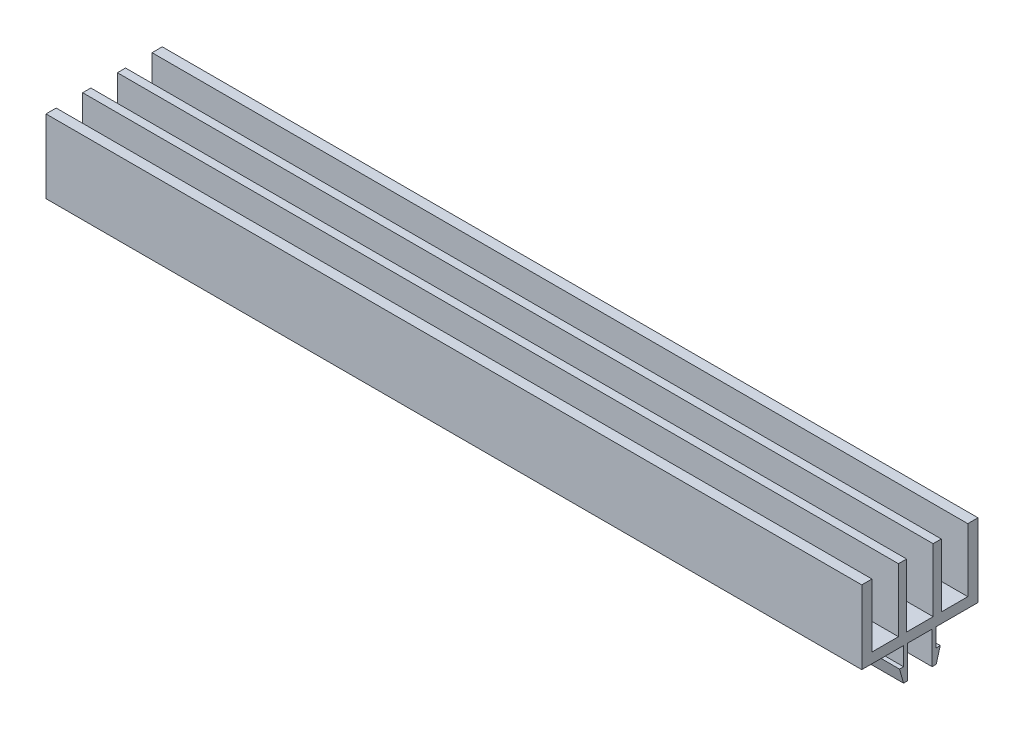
ISO-10303-21;
HEADER;
FILE_DESCRIPTION(('STEP AP214'),'2;1');
FILE_NAME('part.step','',(''),(''),'','','');
FILE_SCHEMA(('AUTOMOTIVE_DESIGN { 1 0 10303 214 1 1 1 1 }'));
ENDSEC;
DATA;
#1=APPLICATION_CONTEXT('core data for automotive mechanical design processes');
#2=APPLICATION_PROTOCOL_DEFINITION('international standard','automotive_design',2000,#1);
#3=PRODUCT_CONTEXT('',#1,'mechanical');
#4=PRODUCT('Part','Part','',(#3));
#5=PRODUCT_RELATED_PRODUCT_CATEGORY('part','',(#4));
#6=PRODUCT_DEFINITION_FORMATION('','',#4);
#7=PRODUCT_DEFINITION_CONTEXT('part definition',#1,'design');
#8=PRODUCT_DEFINITION('design','',#6,#7);
#9=PRODUCT_DEFINITION_SHAPE('','',#8);
#10=(LENGTH_UNIT() NAMED_UNIT(*) SI_UNIT(.MILLI.,.METRE.));
#11=(NAMED_UNIT(*) PLANE_ANGLE_UNIT() SI_UNIT($,.RADIAN.));
#12=(NAMED_UNIT(*) SI_UNIT($,.STERADIAN.) SOLID_ANGLE_UNIT());
#13=UNCERTAINTY_MEASURE_WITH_UNIT(LENGTH_MEASURE(1.E-05),#10,'distance_accuracy_value','');
#14=(GEOMETRIC_REPRESENTATION_CONTEXT(3) GLOBAL_UNCERTAINTY_ASSIGNED_CONTEXT((#13)) GLOBAL_UNIT_ASSIGNED_CONTEXT((#10,
#11,#12)) REPRESENTATION_CONTEXT('',''));
#15=CARTESIAN_POINT('',(0.,0.,0.));
#16=DIRECTION('',(0.,0.,1.));
#17=DIRECTION('',(1.,0.,0.));
#18=AXIS2_PLACEMENT_3D('',#15,#16,#17);
#19=CARTESIAN_POINT('',(200.,-9.434447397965,-4.13110520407));
#20=DIRECTION('',(0.,0.,1.));
#21=DIRECTION('',(1.,0.,0.));
#22=AXIS2_PLACEMENT_3D('',#19,#20,#21);
#23=PLANE('',#22);
#24=DIRECTION('',(0.,1.,0.));
#25=VECTOR('',#24,1.);
#26=CARTESIAN_POINT('',(0.,-9.434447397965,-4.13110520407));
#27=LINE('',#26,#25);
#28=CARTESIAN_POINT('',(0.,-9.434447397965,-4.13110520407));
#29=VERTEX_POINT('',#28);
#30=CARTESIAN_POINT('',(0.,-4.934447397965,-4.13110520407));
#31=VERTEX_POINT('',#30);
#32=EDGE_CURVE('E357',#29,#31,#27,.T.);
#33=ORIENTED_EDGE('',*,*,#32,.T.);
#34=DIRECTION('',(-1.,0.,0.));
#35=VECTOR('',#34,1.);
#36=CARTESIAN_POINT('',(200.,-4.934447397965,-4.13110520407));
#37=LINE('',#36,#35);
#38=CARTESIAN_POINT('',(200.,-4.934447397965,-4.13110520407));
#39=VERTEX_POINT('',#38);
#40=EDGE_CURVE('E13',#39,#31,#37,.T.);
#41=ORIENTED_EDGE('',*,*,#40,.F.);
#42=DIRECTION('',(0.,1.,0.));
#43=VECTOR('',#42,1.);
#44=CARTESIAN_POINT('',(200.,-9.434447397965,-4.13110520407));
#45=LINE('',#44,#43);
#46=CARTESIAN_POINT('',(200.,-9.434447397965,-4.13110520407));
#47=VERTEX_POINT('',#46);
#48=EDGE_CURVE('E439',#47,#39,#45,.T.);
#49=ORIENTED_EDGE('',*,*,#48,.F.);
#50=DIRECTION('',(-1.,0.,0.));
#51=VECTOR('',#50,1.);
#52=CARTESIAN_POINT('',(200.,-9.434447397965,-4.13110520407));
#53=LINE('',#52,#51);
#54=EDGE_CURVE('E353',#47,#29,#53,.T.);
#55=ORIENTED_EDGE('',*,*,#54,.T.);
#56=EDGE_LOOP('',(#33,#41,#49,#55));
#57=FACE_BOUND('',#56,.T.);
#58=ADVANCED_FACE('F136',(#57),#23,.F.);
#59=CARTESIAN_POINT('',(200.,-4.934447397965,-4.13110520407));
#60=DIRECTION('',(0.,1.,0.));
#61=DIRECTION('',(0.,0.,1.));
#62=AXIS2_PLACEMENT_3D('',#59,#60,#61);
#63=PLANE('',#62);
#64=DIRECTION('',(0.,0.,-1.));
#65=VECTOR('',#64,1.);
#66=CARTESIAN_POINT('',(0.,-4.934447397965,-4.13110520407));
#67=LINE('',#66,#65);
#68=CARTESIAN_POINT('',(0.,-4.93444739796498,-14.38110520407));
#69=VERTEX_POINT('',#68);
#70=EDGE_CURVE('E361',#31,#69,#67,.T.);
#71=ORIENTED_EDGE('',*,*,#70,.T.);
#72=DIRECTION('',(-1.,0.,0.));
#73=VECTOR('',#72,1.);
#74=CARTESIAN_POINT('',(200.,-4.93444739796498,-14.38110520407));
#75=LINE('',#74,#73);
#76=CARTESIAN_POINT('',(200.,-4.93444739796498,-14.38110520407));
#77=VERTEX_POINT('',#76);
#78=EDGE_CURVE('E145',#77,#69,#75,.T.);
#79=ORIENTED_EDGE('',*,*,#78,.F.);
#80=DIRECTION('',(0.,0.,-1.));
#81=VECTOR('',#80,1.);
#82=CARTESIAN_POINT('',(200.,-4.934447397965,-4.13110520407));
#83=LINE('',#82,#81);
#84=EDGE_CURVE('E256',#39,#77,#83,.T.);
#85=ORIENTED_EDGE('',*,*,#84,.F.);
#86=ORIENTED_EDGE('',*,*,#40,.T.);
#87=EDGE_LOOP('',(#71,#79,#85,#86));
#88=FACE_BOUND('',#87,.T.);
#89=ADVANCED_FACE('F645',(#88),#63,.F.);
#90=CARTESIAN_POINT('',(200.,-4.93444739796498,-14.38110520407));
#91=DIRECTION('',(0.,0.,1.));
#92=DIRECTION('',(1.,0.,0.));
#93=AXIS2_PLACEMENT_3D('',#90,#91,#92);
#94=PLANE('',#93);
#95=DIRECTION('',(0.,1.,0.));
#96=VECTOR('',#95,1.);
#97=CARTESIAN_POINT('',(0.,-4.93444739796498,-14.38110520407));
#98=LINE('',#97,#96);
#99=CARTESIAN_POINT('',(0.,13.065552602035,-14.38110520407));
#100=VERTEX_POINT('',#99);
#101=EDGE_CURVE('E364',#69,#100,#98,.T.);
#102=ORIENTED_EDGE('',*,*,#101,.T.);
#103=DIRECTION('',(-1.,0.,0.));
#104=VECTOR('',#103,1.);
#105=CARTESIAN_POINT('',(200.,13.065552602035,-14.38110520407));
#106=LINE('',#105,#104);
#107=CARTESIAN_POINT('',(200.,13.065552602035,-14.38110520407));
#108=VERTEX_POINT('',#107);
#109=EDGE_CURVE('E530',#108,#100,#106,.T.);
#110=ORIENTED_EDGE('',*,*,#109,.F.);
#111=DIRECTION('',(0.,1.,0.));
#112=VECTOR('',#111,1.);
#113=CARTESIAN_POINT('',(200.,-4.93444739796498,-14.38110520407));
#114=LINE('',#113,#112);
#115=EDGE_CURVE('E540',#77,#108,#114,.T.);
#116=ORIENTED_EDGE('',*,*,#115,.F.);
#117=ORIENTED_EDGE('',*,*,#78,.T.);
#118=EDGE_LOOP('',(#102,#110,#116,#117));
#119=FACE_BOUND('',#118,.T.);
#120=ADVANCED_FACE('F538',(#119),#94,.F.);
#121=CARTESIAN_POINT('',(200.,13.065552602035,-14.38110520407));
#122=DIRECTION('',(0.,-1.,0.));
#123=DIRECTION('',(0.,0.,-1.));
#124=AXIS2_PLACEMENT_3D('',#121,#122,#123);
#125=PLANE('',#124);
#126=DIRECTION('',(0.,0.,1.));
#127=VECTOR('',#126,1.);
#128=CARTESIAN_POINT('',(0.,13.065552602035,-14.38110520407));
#129=LINE('',#128,#127);
#130=CARTESIAN_POINT('',(0.,13.065552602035,-11.88110520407));
#131=VERTEX_POINT('',#130);
#132=EDGE_CURVE('E367',#100,#131,#129,.T.);
#133=ORIENTED_EDGE('',*,*,#132,.T.);
#134=DIRECTION('',(-1.,0.,0.));
#135=VECTOR('',#134,1.);
#136=CARTESIAN_POINT('',(200.,13.065552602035,-11.88110520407));
#137=LINE('',#136,#135);
#138=CARTESIAN_POINT('',(200.,13.065552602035,-11.88110520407));
#139=VERTEX_POINT('',#138);
#140=EDGE_CURVE('E526',#139,#131,#137,.T.);
#141=ORIENTED_EDGE('',*,*,#140,.F.);
#142=DIRECTION('',(0.,0.,1.));
#143=VECTOR('',#142,1.);
#144=CARTESIAN_POINT('',(200.,13.065552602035,-14.38110520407));
#145=LINE('',#144,#143);
#146=EDGE_CURVE('E559',#108,#139,#145,.T.);
#147=ORIENTED_EDGE('',*,*,#146,.F.);
#148=ORIENTED_EDGE('',*,*,#109,.T.);
#149=EDGE_LOOP('',(#133,#141,#147,#148));
#150=FACE_BOUND('',#149,.T.);
#151=ADVANCED_FACE('F549',(#150),#125,.F.);
#152=CARTESIAN_POINT('',(200.,13.065552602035,-11.88110520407));
#153=DIRECTION('',(0.,0.,-1.));
#154=DIRECTION('',(-1.,0.,0.));
#155=AXIS2_PLACEMENT_3D('',#152,#153,#154);
#156=PLANE('',#155);
#157=DIRECTION('',(0.,-1.,0.));
#158=VECTOR('',#157,1.);
#159=CARTESIAN_POINT('',(0.,13.065552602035,-11.88110520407));
#160=LINE('',#159,#158);
#161=CARTESIAN_POINT('',(0.,-2.434447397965,-11.88110520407));
#162=VERTEX_POINT('',#161);
#163=EDGE_CURVE('E370',#131,#162,#160,.T.);
#164=ORIENTED_EDGE('',*,*,#163,.T.);
#165=DIRECTION('',(-1.,0.,0.));
#166=VECTOR('',#165,1.);
#167=CARTESIAN_POINT('',(200.,-2.434447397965,-11.88110520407));
#168=LINE('',#167,#166);
#169=CARTESIAN_POINT('',(200.,-2.434447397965,-11.88110520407));
#170=VERTEX_POINT('',#169);
#171=EDGE_CURVE('E522',#170,#162,#168,.T.);
#172=ORIENTED_EDGE('',*,*,#171,.F.);
#173=DIRECTION('',(0.,-1.,0.));
#174=VECTOR('',#173,1.);
#175=CARTESIAN_POINT('',(200.,13.065552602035,-11.88110520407));
#176=LINE('',#175,#174);
#177=EDGE_CURVE('E555',#139,#170,#176,.T.);
#178=ORIENTED_EDGE('',*,*,#177,.F.);
#179=ORIENTED_EDGE('',*,*,#140,.T.);
#180=EDGE_LOOP('',(#164,#172,#178,#179));
#181=FACE_BOUND('',#180,.T.);
#182=ADVANCED_FACE('F553',(#181),#156,.F.);
#183=CARTESIAN_POINT('',(200.,-2.434447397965,-11.88110520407));
#184=DIRECTION('',(0.,-1.,0.));
#185=DIRECTION('',(0.,0.,-1.));
#186=AXIS2_PLACEMENT_3D('',#183,#184,#185);
#187=PLANE('',#186);
#188=DIRECTION('',(0.,0.,1.));
#189=VECTOR('',#188,1.);
#190=CARTESIAN_POINT('',(0.,-2.434447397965,-11.88110520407));
#191=LINE('',#190,#189);
#192=CARTESIAN_POINT('',(0.,-2.434447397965,-5.38110520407));
#193=VERTEX_POINT('',#192);
#194=EDGE_CURVE('E373',#162,#193,#191,.T.);
#195=ORIENTED_EDGE('',*,*,#194,.T.);
#196=DIRECTION('',(-1.,0.,0.));
#197=VECTOR('',#196,1.);
#198=CARTESIAN_POINT('',(200.,-2.434447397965,-5.38110520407));
#199=LINE('',#198,#197);
#200=CARTESIAN_POINT('',(200.,-2.434447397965,-5.38110520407));
#201=VERTEX_POINT('',#200);
#202=EDGE_CURVE('E518',#201,#193,#199,.T.);
#203=ORIENTED_EDGE('',*,*,#202,.F.);
#204=DIRECTION('',(0.,0.,1.));
#205=VECTOR('',#204,1.);
#206=CARTESIAN_POINT('',(200.,-2.434447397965,-11.88110520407));
#207=LINE('',#206,#205);
#208=EDGE_CURVE('E558',#170,#201,#207,.T.);
#209=ORIENTED_EDGE('',*,*,#208,.F.);
#210=ORIENTED_EDGE('',*,*,#171,.T.);
#211=EDGE_LOOP('',(#195,#203,#209,#210));
#212=FACE_BOUND('',#211,.T.);
#213=ADVANCED_FACE('F658',(#212),#187,.F.);
#214=CARTESIAN_POINT('',(200.,-2.434447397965,-5.38110520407));
#215=DIRECTION('',(0.,0.,1.));
#216=DIRECTION('',(1.,0.,0.));
#217=AXIS2_PLACEMENT_3D('',#214,#215,#216);
#218=PLANE('',#217);
#219=DIRECTION('',(0.,1.,0.));
#220=VECTOR('',#219,1.);
#221=CARTESIAN_POINT('',(0.,-2.434447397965,-5.38110520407));
#222=LINE('',#221,#220);
#223=CARTESIAN_POINT('',(0.,13.065552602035,-5.38110520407));
#224=VERTEX_POINT('',#223);
#225=EDGE_CURVE('E376',#193,#224,#222,.T.);
#226=ORIENTED_EDGE('',*,*,#225,.T.);
#227=DIRECTION('',(-1.,0.,0.));
#228=VECTOR('',#227,1.);
#229=CARTESIAN_POINT('',(200.,13.065552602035,-5.38110520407));
#230=LINE('',#229,#228);
#231=CARTESIAN_POINT('',(200.,13.065552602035,-5.38110520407));
#232=VERTEX_POINT('',#231);
#233=EDGE_CURVE('E514',#232,#224,#230,.T.);
#234=ORIENTED_EDGE('',*,*,#233,.F.);
#235=DIRECTION('',(0.,1.,0.));
#236=VECTOR('',#235,1.);
#237=CARTESIAN_POINT('',(200.,-2.434447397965,-5.38110520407));
#238=LINE('',#237,#236);
#239=EDGE_CURVE('E563',#201,#232,#238,.T.);
#240=ORIENTED_EDGE('',*,*,#239,.F.);
#241=ORIENTED_EDGE('',*,*,#202,.T.);
#242=EDGE_LOOP('',(#226,#234,#240,#241));
#243=FACE_BOUND('',#242,.T.);
#244=ADVANCED_FACE('F661',(#243),#218,.F.);
#245=CARTESIAN_POINT('',(200.,13.065552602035,-5.38110520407));
#246=DIRECTION('',(0.,-1.,0.));
#247=DIRECTION('',(0.,0.,-1.));
#248=AXIS2_PLACEMENT_3D('',#245,#246,#247);
#249=PLANE('',#248);
#250=DIRECTION('',(0.,0.,1.));
#251=VECTOR('',#250,1.);
#252=CARTESIAN_POINT('',(0.,13.065552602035,-5.38110520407));
#253=LINE('',#252,#251);
#254=CARTESIAN_POINT('',(0.,13.065552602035,-3.38110520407));
#255=VERTEX_POINT('',#254);
#256=EDGE_CURVE('E379',#224,#255,#253,.T.);
#257=ORIENTED_EDGE('',*,*,#256,.T.);
#258=DIRECTION('',(-1.,0.,0.));
#259=VECTOR('',#258,1.);
#260=CARTESIAN_POINT('',(200.,13.065552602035,-3.38110520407));
#261=LINE('',#260,#259);
#262=CARTESIAN_POINT('',(200.,13.065552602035,-3.38110520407));
#263=VERTEX_POINT('',#262);
#264=EDGE_CURVE('E510',#263,#255,#261,.T.);
#265=ORIENTED_EDGE('',*,*,#264,.F.);
#266=DIRECTION('',(0.,0.,1.));
#267=VECTOR('',#266,1.);
#268=CARTESIAN_POINT('',(200.,13.065552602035,-5.38110520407));
#269=LINE('',#268,#267);
#270=EDGE_CURVE('E570',#232,#263,#269,.T.);
#271=ORIENTED_EDGE('',*,*,#270,.F.);
#272=ORIENTED_EDGE('',*,*,#233,.T.);
#273=EDGE_LOOP('',(#257,#265,#271,#272));
#274=FACE_BOUND('',#273,.T.);
#275=ADVANCED_FACE('F665',(#274),#249,.F.);
#276=CARTESIAN_POINT('',(200.,13.065552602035,-3.38110520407));
#277=DIRECTION('',(0.,0.,-1.));
#278=DIRECTION('',(-1.,0.,0.));
#279=AXIS2_PLACEMENT_3D('',#276,#277,#278);
#280=PLANE('',#279);
#281=DIRECTION('',(0.,-1.,0.));
#282=VECTOR('',#281,1.);
#283=CARTESIAN_POINT('',(0.,13.065552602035,-3.38110520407));
#284=LINE('',#283,#282);
#285=CARTESIAN_POINT('',(0.,-2.434447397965,-3.38110520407));
#286=VERTEX_POINT('',#285);
#287=EDGE_CURVE('E382',#255,#286,#284,.T.);
#288=ORIENTED_EDGE('',*,*,#287,.T.);
#289=DIRECTION('',(-1.,0.,0.));
#290=VECTOR('',#289,1.);
#291=CARTESIAN_POINT('',(200.,-2.434447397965,-3.38110520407));
#292=LINE('',#291,#290);
#293=CARTESIAN_POINT('',(200.,-2.434447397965,-3.38110520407));
#294=VERTEX_POINT('',#293);
#295=EDGE_CURVE('E506',#294,#286,#292,.T.);
#296=ORIENTED_EDGE('',*,*,#295,.F.);
#297=DIRECTION('',(0.,-1.,0.));
#298=VECTOR('',#297,1.);
#299=CARTESIAN_POINT('',(200.,13.065552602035,-3.38110520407));
#300=LINE('',#299,#298);
#301=EDGE_CURVE('E573',#263,#294,#300,.T.);
#302=ORIENTED_EDGE('',*,*,#301,.F.);
#303=ORIENTED_EDGE('',*,*,#264,.T.);
#304=EDGE_LOOP('',(#288,#296,#302,#303));
#305=FACE_BOUND('',#304,.T.);
#306=ADVANCED_FACE('F669',(#305),#280,.F.);
#307=CARTESIAN_POINT('',(200.,-2.434447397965,-3.38110520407));
#308=DIRECTION('',(0.,-1.,0.));
#309=DIRECTION('',(0.,0.,-1.));
#310=AXIS2_PLACEMENT_3D('',#307,#308,#309);
#311=PLANE('',#310);
#312=DIRECTION('',(0.,0.,1.));
#313=VECTOR('',#312,1.);
#314=CARTESIAN_POINT('',(0.,-2.434447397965,-3.38110520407));
#315=LINE('',#314,#313);
#316=CARTESIAN_POINT('',(0.,-2.434447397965,3.11889479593));
#317=VERTEX_POINT('',#316);
#318=EDGE_CURVE('E385',#286,#317,#315,.T.);
#319=ORIENTED_EDGE('',*,*,#318,.T.);
#320=DIRECTION('',(-1.,0.,0.));
#321=VECTOR('',#320,1.);
#322=CARTESIAN_POINT('',(200.,-2.434447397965,3.11889479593));
#323=LINE('',#322,#321);
#324=CARTESIAN_POINT('',(200.,-2.434447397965,3.11889479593));
#325=VERTEX_POINT('',#324);
#326=EDGE_CURVE('E502',#325,#317,#323,.T.);
#327=ORIENTED_EDGE('',*,*,#326,.F.);
#328=DIRECTION('',(0.,0.,1.));
#329=VECTOR('',#328,1.);
#330=CARTESIAN_POINT('',(200.,-2.434447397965,-3.38110520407));
#331=LINE('',#330,#329);
#332=EDGE_CURVE('E576',#294,#325,#331,.T.);
#333=ORIENTED_EDGE('',*,*,#332,.F.);
#334=ORIENTED_EDGE('',*,*,#295,.T.);
#335=EDGE_LOOP('',(#319,#327,#333,#334));
#336=FACE_BOUND('',#335,.T.);
#337=ADVANCED_FACE('F673',(#336),#311,.F.);
#338=CARTESIAN_POINT('',(200.,-2.434447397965,3.11889479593));
#339=DIRECTION('',(0.,0.,1.));
#340=DIRECTION('',(1.,0.,0.));
#341=AXIS2_PLACEMENT_3D('',#338,#339,#340);
#342=PLANE('',#341);
#343=DIRECTION('',(0.,1.,0.));
#344=VECTOR('',#343,1.);
#345=CARTESIAN_POINT('',(0.,-2.434447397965,3.11889479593));
#346=LINE('',#345,#344);
#347=CARTESIAN_POINT('',(0.,13.065552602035,3.11889479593));
#348=VERTEX_POINT('',#347);
#349=EDGE_CURVE('E388',#317,#348,#346,.T.);
#350=ORIENTED_EDGE('',*,*,#349,.T.);
#351=DIRECTION('',(-1.,0.,0.));
#352=VECTOR('',#351,1.);
#353=CARTESIAN_POINT('',(200.,13.065552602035,3.11889479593));
#354=LINE('',#353,#352);
#355=CARTESIAN_POINT('',(200.,13.065552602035,3.11889479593));
#356=VERTEX_POINT('',#355);
#357=EDGE_CURVE('E498',#356,#348,#354,.T.);
#358=ORIENTED_EDGE('',*,*,#357,.F.);
#359=DIRECTION('',(0.,1.,0.));
#360=VECTOR('',#359,1.);
#361=CARTESIAN_POINT('',(200.,-2.434447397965,3.11889479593));
#362=LINE('',#361,#360);
#363=EDGE_CURVE('E579',#325,#356,#362,.T.);
#364=ORIENTED_EDGE('',*,*,#363,.F.);
#365=ORIENTED_EDGE('',*,*,#326,.T.);
#366=EDGE_LOOP('',(#350,#358,#364,#365));
#367=FACE_BOUND('',#366,.T.);
#368=ADVANCED_FACE('F677',(#367),#342,.F.);
#369=CARTESIAN_POINT('',(200.,13.065552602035,3.11889479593));
#370=DIRECTION('',(0.,-1.,0.));
#371=DIRECTION('',(0.,0.,-1.));
#372=AXIS2_PLACEMENT_3D('',#369,#370,#371);
#373=PLANE('',#372);
#374=DIRECTION('',(0.,0.,1.));
#375=VECTOR('',#374,1.);
#376=CARTESIAN_POINT('',(0.,13.065552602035,3.11889479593));
#377=LINE('',#376,#375);
#378=CARTESIAN_POINT('',(0.,13.065552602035,5.11889479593));
#379=VERTEX_POINT('',#378);
#380=EDGE_CURVE('E391',#348,#379,#377,.T.);
#381=ORIENTED_EDGE('',*,*,#380,.T.);
#382=DIRECTION('',(-1.,0.,0.));
#383=VECTOR('',#382,1.);
#384=CARTESIAN_POINT('',(200.,13.065552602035,5.11889479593));
#385=LINE('',#384,#383);
#386=CARTESIAN_POINT('',(200.,13.065552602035,5.11889479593));
#387=VERTEX_POINT('',#386);
#388=EDGE_CURVE('E494',#387,#379,#385,.T.);
#389=ORIENTED_EDGE('',*,*,#388,.F.);
#390=DIRECTION('',(0.,0.,1.));
#391=VECTOR('',#390,1.);
#392=CARTESIAN_POINT('',(200.,13.065552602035,3.11889479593));
#393=LINE('',#392,#391);
#394=EDGE_CURVE('E582',#356,#387,#393,.T.);
#395=ORIENTED_EDGE('',*,*,#394,.F.);
#396=ORIENTED_EDGE('',*,*,#357,.T.);
#397=EDGE_LOOP('',(#381,#389,#395,#396));
#398=FACE_BOUND('',#397,.T.);
#399=ADVANCED_FACE('F681',(#398),#373,.F.);
#400=CARTESIAN_POINT('',(200.,13.065552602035,5.11889479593));
#401=DIRECTION('',(0.,0.,-1.));
#402=DIRECTION('',(-1.,0.,0.));
#403=AXIS2_PLACEMENT_3D('',#400,#401,#402);
#404=PLANE('',#403);
#405=DIRECTION('',(0.,-1.,0.));
#406=VECTOR('',#405,1.);
#407=CARTESIAN_POINT('',(0.,13.065552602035,5.11889479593));
#408=LINE('',#407,#406);
#409=CARTESIAN_POINT('',(0.,-2.434447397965,5.11889479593));
#410=VERTEX_POINT('',#409);
#411=EDGE_CURVE('E394',#379,#410,#408,.T.);
#412=ORIENTED_EDGE('',*,*,#411,.T.);
#413=DIRECTION('',(-1.,0.,0.));
#414=VECTOR('',#413,1.);
#415=CARTESIAN_POINT('',(200.,-2.434447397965,5.11889479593));
#416=LINE('',#415,#414);
#417=CARTESIAN_POINT('',(200.,-2.434447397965,5.11889479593));
#418=VERTEX_POINT('',#417);
#419=EDGE_CURVE('E490',#418,#410,#416,.T.);
#420=ORIENTED_EDGE('',*,*,#419,.F.);
#421=DIRECTION('',(0.,-1.,0.));
#422=VECTOR('',#421,1.);
#423=CARTESIAN_POINT('',(200.,13.065552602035,5.11889479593));
#424=LINE('',#423,#422);
#425=EDGE_CURVE('E585',#387,#418,#424,.T.);
#426=ORIENTED_EDGE('',*,*,#425,.F.);
#427=ORIENTED_EDGE('',*,*,#388,.T.);
#428=EDGE_LOOP('',(#412,#420,#426,#427));
#429=FACE_BOUND('',#428,.T.);
#430=ADVANCED_FACE('F685',(#429),#404,.F.);
#431=CARTESIAN_POINT('',(200.,-2.434447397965,5.11889479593));
#432=DIRECTION('',(0.,-1.,0.));
#433=DIRECTION('',(0.,0.,-1.));
#434=AXIS2_PLACEMENT_3D('',#431,#432,#433);
#435=PLANE('',#434);
#436=DIRECTION('',(0.,0.,1.));
#437=VECTOR('',#436,1.);
#438=CARTESIAN_POINT('',(0.,-2.434447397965,5.11889479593));
#439=LINE('',#438,#437);
#440=CARTESIAN_POINT('',(0.,-2.434447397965,11.61889479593));
#441=VERTEX_POINT('',#440);
#442=EDGE_CURVE('E397',#410,#441,#439,.T.);
#443=ORIENTED_EDGE('',*,*,#442,.T.);
#444=DIRECTION('',(-1.,0.,0.));
#445=VECTOR('',#444,1.);
#446=CARTESIAN_POINT('',(200.,-2.434447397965,11.61889479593));
#447=LINE('',#446,#445);
#448=CARTESIAN_POINT('',(200.,-2.434447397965,11.61889479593));
#449=VERTEX_POINT('',#448);
#450=EDGE_CURVE('E486',#449,#441,#447,.T.);
#451=ORIENTED_EDGE('',*,*,#450,.F.);
#452=DIRECTION('',(0.,0.,1.));
#453=VECTOR('',#452,1.);
#454=CARTESIAN_POINT('',(200.,-2.434447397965,5.11889479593));
#455=LINE('',#454,#453);
#456=EDGE_CURVE('E588',#418,#449,#455,.T.);
#457=ORIENTED_EDGE('',*,*,#456,.F.);
#458=ORIENTED_EDGE('',*,*,#419,.T.);
#459=EDGE_LOOP('',(#443,#451,#457,#458));
#460=FACE_BOUND('',#459,.T.);
#461=ADVANCED_FACE('F689',(#460),#435,.F.);
#462=CARTESIAN_POINT('',(200.,-2.434447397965,11.61889479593));
#463=DIRECTION('',(0.,0.,1.));
#464=DIRECTION('',(1.,0.,0.));
#465=AXIS2_PLACEMENT_3D('',#462,#463,#464);
#466=PLANE('',#465);
#467=DIRECTION('',(0.,1.,0.));
#468=VECTOR('',#467,1.);
#469=CARTESIAN_POINT('',(0.,-2.434447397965,11.61889479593));
#470=LINE('',#469,#468);
#471=CARTESIAN_POINT('',(0.,13.065552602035,11.61889479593));
#472=VERTEX_POINT('',#471);
#473=EDGE_CURVE('E400',#441,#472,#470,.T.);
#474=ORIENTED_EDGE('',*,*,#473,.T.);
#475=DIRECTION('',(-1.,0.,0.));
#476=VECTOR('',#475,1.);
#477=CARTESIAN_POINT('',(200.,13.065552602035,11.61889479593));
#478=LINE('',#477,#476);
#479=CARTESIAN_POINT('',(200.,13.065552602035,11.61889479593));
#480=VERTEX_POINT('',#479);
#481=EDGE_CURVE('E482',#480,#472,#478,.T.);
#482=ORIENTED_EDGE('',*,*,#481,.F.);
#483=DIRECTION('',(0.,1.,0.));
#484=VECTOR('',#483,1.);
#485=CARTESIAN_POINT('',(200.,-2.434447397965,11.61889479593));
#486=LINE('',#485,#484);
#487=EDGE_CURVE('E591',#449,#480,#486,.T.);
#488=ORIENTED_EDGE('',*,*,#487,.F.);
#489=ORIENTED_EDGE('',*,*,#450,.T.);
#490=EDGE_LOOP('',(#474,#482,#488,#489));
#491=FACE_BOUND('',#490,.T.);
#492=ADVANCED_FACE('F693',(#491),#466,.F.);
#493=CARTESIAN_POINT('',(200.,13.065552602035,11.61889479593));
#494=DIRECTION('',(0.,-1.,0.));
#495=DIRECTION('',(0.,0.,-1.));
#496=AXIS2_PLACEMENT_3D('',#493,#494,#495);
#497=PLANE('',#496);
#498=DIRECTION('',(0.,0.,1.));
#499=VECTOR('',#498,1.);
#500=CARTESIAN_POINT('',(0.,13.065552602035,11.61889479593));
#501=LINE('',#500,#499);
#502=CARTESIAN_POINT('',(0.,13.065552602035,14.11889479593));
#503=VERTEX_POINT('',#502);
#504=EDGE_CURVE('E403',#472,#503,#501,.T.);
#505=ORIENTED_EDGE('',*,*,#504,.T.);
#506=DIRECTION('',(-1.,0.,0.));
#507=VECTOR('',#506,1.);
#508=CARTESIAN_POINT('',(200.,13.065552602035,14.11889479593));
#509=LINE('',#508,#507);
#510=CARTESIAN_POINT('',(200.,13.065552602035,14.11889479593));
#511=VERTEX_POINT('',#510);
#512=EDGE_CURVE('E478',#511,#503,#509,.T.);
#513=ORIENTED_EDGE('',*,*,#512,.F.);
#514=DIRECTION('',(0.,0.,1.));
#515=VECTOR('',#514,1.);
#516=CARTESIAN_POINT('',(200.,13.065552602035,11.61889479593));
#517=LINE('',#516,#515);
#518=EDGE_CURVE('E594',#480,#511,#517,.T.);
#519=ORIENTED_EDGE('',*,*,#518,.F.);
#520=ORIENTED_EDGE('',*,*,#481,.T.);
#521=EDGE_LOOP('',(#505,#513,#519,#520));
#522=FACE_BOUND('',#521,.T.);
#523=ADVANCED_FACE('F697',(#522),#497,.F.);
#524=CARTESIAN_POINT('',(200.,13.065552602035,14.11889479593));
#525=DIRECTION('',(0.,0.,-1.));
#526=DIRECTION('',(-1.,0.,0.));
#527=AXIS2_PLACEMENT_3D('',#524,#525,#526);
#528=PLANE('',#527);
#529=DIRECTION('',(0.,-1.,0.));
#530=VECTOR('',#529,1.);
#531=CARTESIAN_POINT('',(0.,13.065552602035,14.11889479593));
#532=LINE('',#531,#530);
#533=CARTESIAN_POINT('',(0.,-4.934447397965,14.11889479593));
#534=VERTEX_POINT('',#533);
#535=EDGE_CURVE('E406',#503,#534,#532,.T.);
#536=ORIENTED_EDGE('',*,*,#535,.T.);
#537=DIRECTION('',(-1.,0.,0.));
#538=VECTOR('',#537,1.);
#539=CARTESIAN_POINT('',(200.,-4.934447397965,14.11889479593));
#540=LINE('',#539,#538);
#541=CARTESIAN_POINT('',(200.,-4.934447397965,14.11889479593));
#542=VERTEX_POINT('',#541);
#543=EDGE_CURVE('E474',#542,#534,#540,.T.);
#544=ORIENTED_EDGE('',*,*,#543,.F.);
#545=DIRECTION('',(0.,-1.,0.));
#546=VECTOR('',#545,1.);
#547=CARTESIAN_POINT('',(200.,13.065552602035,14.11889479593));
#548=LINE('',#547,#546);
#549=EDGE_CURVE('E597',#511,#542,#548,.T.);
#550=ORIENTED_EDGE('',*,*,#549,.F.);
#551=ORIENTED_EDGE('',*,*,#512,.T.);
#552=EDGE_LOOP('',(#536,#544,#550,#551));
#553=FACE_BOUND('',#552,.T.);
#554=ADVANCED_FACE('F701',(#553),#528,.F.);
#555=CARTESIAN_POINT('',(200.,-4.934447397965,14.11889479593));
#556=DIRECTION('',(0.,1.,0.));
#557=DIRECTION('',(0.,0.,1.));
#558=AXIS2_PLACEMENT_3D('',#555,#556,#557);
#559=PLANE('',#558);
#560=DIRECTION('',(0.,0.,-1.));
#561=VECTOR('',#560,1.);
#562=CARTESIAN_POINT('',(0.,-4.934447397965,14.11889479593));
#563=LINE('',#562,#561);
#564=CARTESIAN_POINT('',(0.,-4.934447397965,3.86889479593));
#565=VERTEX_POINT('',#564);
#566=EDGE_CURVE('E409',#534,#565,#563,.T.);
#567=ORIENTED_EDGE('',*,*,#566,.T.);
#568=DIRECTION('',(-1.,0.,0.));
#569=VECTOR('',#568,1.);
#570=CARTESIAN_POINT('',(200.,-4.934447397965,3.86889479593));
#571=LINE('',#570,#569);
#572=CARTESIAN_POINT('',(200.,-4.934447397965,3.86889479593));
#573=VERTEX_POINT('',#572);
#574=EDGE_CURVE('E470',#573,#565,#571,.T.);
#575=ORIENTED_EDGE('',*,*,#574,.F.);
#576=DIRECTION('',(0.,0.,-1.));
#577=VECTOR('',#576,1.);
#578=CARTESIAN_POINT('',(200.,-4.934447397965,14.11889479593));
#579=LINE('',#578,#577);
#580=EDGE_CURVE('E600',#542,#573,#579,.T.);
#581=ORIENTED_EDGE('',*,*,#580,.F.);
#582=ORIENTED_EDGE('',*,*,#543,.T.);
#583=EDGE_LOOP('',(#567,#575,#581,#582));
#584=FACE_BOUND('',#583,.T.);
#585=ADVANCED_FACE('F705',(#584),#559,.F.);
#586=CARTESIAN_POINT('',(200.,-4.934447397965,3.86889479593));
#587=DIRECTION('',(0.,0.,-1.));
#588=DIRECTION('',(-1.,0.,0.));
#589=AXIS2_PLACEMENT_3D('',#586,#587,#588);
#590=PLANE('',#589);
#591=DIRECTION('',(0.,-1.,0.));
#592=VECTOR('',#591,1.);
#593=CARTESIAN_POINT('',(0.,-4.934447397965,3.86889479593));
#594=LINE('',#593,#592);
#595=CARTESIAN_POINT('',(0.,-9.434447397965,3.86889479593));
#596=VERTEX_POINT('',#595);
#597=EDGE_CURVE('E412',#565,#596,#594,.T.);
#598=ORIENTED_EDGE('',*,*,#597,.T.);
#599=DIRECTION('',(-1.,0.,0.));
#600=VECTOR('',#599,1.);
#601=CARTESIAN_POINT('',(200.,-9.434447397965,3.86889479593));
#602=LINE('',#601,#600);
#603=CARTESIAN_POINT('',(200.,-9.434447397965,3.86889479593));
#604=VERTEX_POINT('',#603);
#605=EDGE_CURVE('E466',#604,#596,#602,.T.);
#606=ORIENTED_EDGE('',*,*,#605,.F.);
#607=DIRECTION('',(0.,-1.,0.));
#608=VECTOR('',#607,1.);
#609=CARTESIAN_POINT('',(200.,-4.934447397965,3.86889479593));
#610=LINE('',#609,#608);
#611=EDGE_CURVE('E603',#573,#604,#610,.T.);
#612=ORIENTED_EDGE('',*,*,#611,.F.);
#613=ORIENTED_EDGE('',*,*,#574,.T.);
#614=EDGE_LOOP('',(#598,#606,#612,#613));
#615=FACE_BOUND('',#614,.T.);
#616=ADVANCED_FACE('F709',(#615),#590,.F.);
#617=CARTESIAN_POINT('',(200.,-9.434447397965,3.86889479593));
#618=DIRECTION('',(0.,-1.,0.));
#619=DIRECTION('',(0.,0.,-1.));
#620=AXIS2_PLACEMENT_3D('',#617,#618,#619);
#621=PLANE('',#620);
#622=DIRECTION('',(0.,0.,1.));
#623=VECTOR('',#622,1.);
#624=CARTESIAN_POINT('',(0.,-9.434447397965,3.86889479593));
#625=LINE('',#624,#623);
#626=CARTESIAN_POINT('',(0.,-9.434447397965,4.86889479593));
#627=VERTEX_POINT('',#626);
#628=EDGE_CURVE('E415',#596,#627,#625,.T.);
#629=ORIENTED_EDGE('',*,*,#628,.T.);
#630=DIRECTION('',(-1.,0.,0.));
#631=VECTOR('',#630,1.);
#632=CARTESIAN_POINT('',(200.,-9.434447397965,4.86889479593));
#633=LINE('',#632,#631);
#634=CARTESIAN_POINT('',(200.,-9.434447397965,4.86889479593));
#635=VERTEX_POINT('',#634);
#636=EDGE_CURVE('E462',#635,#627,#633,.T.);
#637=ORIENTED_EDGE('',*,*,#636,.F.);
#638=DIRECTION('',(0.,0.,1.));
#639=VECTOR('',#638,1.);
#640=CARTESIAN_POINT('',(200.,-9.434447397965,3.86889479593));
#641=LINE('',#640,#639);
#642=EDGE_CURVE('E606',#604,#635,#641,.T.);
#643=ORIENTED_EDGE('',*,*,#642,.F.);
#644=ORIENTED_EDGE('',*,*,#605,.T.);
#645=EDGE_LOOP('',(#629,#637,#643,#644));
#646=FACE_BOUND('',#645,.T.);
#647=ADVANCED_FACE('F713',(#646),#621,.F.);
#648=CARTESIAN_POINT('',(200.,-9.434447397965,4.86889479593));
#649=DIRECTION('',(0.,0.274721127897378,-0.961523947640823));
#650=DIRECTION('',(0.,0.961523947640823,0.274721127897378));
#651=AXIS2_PLACEMENT_3D('',#648,#649,#650);
#652=PLANE('',#651);
#653=DIRECTION('',(0.,-0.961523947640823,-0.274721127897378));
#654=VECTOR('',#653,1.);
#655=CARTESIAN_POINT('',(0.,-9.434447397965,4.86889479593));
#656=LINE('',#655,#654);
#657=CARTESIAN_POINT('',(0.,-12.934447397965,3.86889479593));
#658=VERTEX_POINT('',#657);
#659=EDGE_CURVE('E418',#627,#658,#656,.T.);
#660=ORIENTED_EDGE('',*,*,#659,.T.);
#661=DIRECTION('',(-1.,0.,0.));
#662=VECTOR('',#661,1.);
#663=CARTESIAN_POINT('',(200.,-12.934447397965,3.86889479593));
#664=LINE('',#663,#662);
#665=CARTESIAN_POINT('',(200.,-12.934447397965,3.86889479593));
#666=VERTEX_POINT('',#665);
#667=EDGE_CURVE('E458',#666,#658,#664,.T.);
#668=ORIENTED_EDGE('',*,*,#667,.F.);
#669=DIRECTION('',(0.,-0.961523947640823,-0.274721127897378));
#670=VECTOR('',#669,1.);
#671=CARTESIAN_POINT('',(200.,-9.434447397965,4.86889479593));
#672=LINE('',#671,#670);
#673=EDGE_CURVE('E609',#635,#666,#672,.T.);
#674=ORIENTED_EDGE('',*,*,#673,.F.);
#675=ORIENTED_EDGE('',*,*,#636,.T.);
#676=EDGE_LOOP('',(#660,#668,#674,#675));
#677=FACE_BOUND('',#676,.T.);
#678=ADVANCED_FACE('F717',(#677),#652,.F.);
#679=CARTESIAN_POINT('',(200.,-12.934447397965,3.86889479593));
#680=DIRECTION('',(0.,1.,0.));
#681=DIRECTION('',(0.,0.,1.));
#682=AXIS2_PLACEMENT_3D('',#679,#680,#681);
#683=PLANE('',#682);
#684=DIRECTION('',(0.,0.,-1.));
#685=VECTOR('',#684,1.);
#686=CARTESIAN_POINT('',(0.,-12.934447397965,3.86889479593));
#687=LINE('',#686,#685);
#688=CARTESIAN_POINT('',(0.,-12.934447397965,2.86889479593));
#689=VERTEX_POINT('',#688);
#690=EDGE_CURVE('E421',#658,#689,#687,.T.);
#691=ORIENTED_EDGE('',*,*,#690,.T.);
#692=DIRECTION('',(-1.,0.,0.));
#693=VECTOR('',#692,1.);
#694=CARTESIAN_POINT('',(200.,-12.934447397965,2.86889479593));
#695=LINE('',#694,#693);
#696=CARTESIAN_POINT('',(200.,-12.934447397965,2.86889479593));
#697=VERTEX_POINT('',#696);
#698=EDGE_CURVE('E454',#697,#689,#695,.T.);
#699=ORIENTED_EDGE('',*,*,#698,.F.);
#700=DIRECTION('',(0.,0.,-1.));
#701=VECTOR('',#700,1.);
#702=CARTESIAN_POINT('',(200.,-12.934447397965,3.86889479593));
#703=LINE('',#702,#701);
#704=EDGE_CURVE('E612',#666,#697,#703,.T.);
#705=ORIENTED_EDGE('',*,*,#704,.F.);
#706=ORIENTED_EDGE('',*,*,#667,.T.);
#707=EDGE_LOOP('',(#691,#699,#705,#706));
#708=FACE_BOUND('',#707,.T.);
#709=ADVANCED_FACE('F721',(#708),#683,.F.);
#710=CARTESIAN_POINT('',(200.,-12.934447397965,2.86889479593));
#711=DIRECTION('',(0.,0.,1.));
#712=DIRECTION('',(1.,0.,0.));
#713=AXIS2_PLACEMENT_3D('',#710,#711,#712);
#714=PLANE('',#713);
#715=DIRECTION('',(0.,1.,0.));
#716=VECTOR('',#715,1.);
#717=CARTESIAN_POINT('',(0.,-12.934447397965,2.86889479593));
#718=LINE('',#717,#716);
#719=CARTESIAN_POINT('',(0.,-4.934447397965,2.86889479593));
#720=VERTEX_POINT('',#719);
#721=EDGE_CURVE('E424',#689,#720,#718,.T.);
#722=ORIENTED_EDGE('',*,*,#721,.T.);
#723=DIRECTION('',(-1.,0.,0.));
#724=VECTOR('',#723,1.);
#725=CARTESIAN_POINT('',(200.,-4.934447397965,2.86889479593));
#726=LINE('',#725,#724);
#727=CARTESIAN_POINT('',(200.,-4.934447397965,2.86889479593));
#728=VERTEX_POINT('',#727);
#729=EDGE_CURVE('E450',#728,#720,#726,.T.);
#730=ORIENTED_EDGE('',*,*,#729,.F.);
#731=DIRECTION('',(0.,1.,0.));
#732=VECTOR('',#731,1.);
#733=CARTESIAN_POINT('',(200.,-12.934447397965,2.86889479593));
#734=LINE('',#733,#732);
#735=EDGE_CURVE('E615',#697,#728,#734,.T.);
#736=ORIENTED_EDGE('',*,*,#735,.F.);
#737=ORIENTED_EDGE('',*,*,#698,.T.);
#738=EDGE_LOOP('',(#722,#730,#736,#737));
#739=FACE_BOUND('',#738,.T.);
#740=ADVANCED_FACE('F725',(#739),#714,.F.);
#741=CARTESIAN_POINT('',(200.,-4.934447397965,2.86889479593));
#742=DIRECTION('',(0.,1.,0.));
#743=DIRECTION('',(0.,0.,1.));
#744=AXIS2_PLACEMENT_3D('',#741,#742,#743);
#745=PLANE('',#744);
#746=DIRECTION('',(0.,0.,-1.));
#747=VECTOR('',#746,1.);
#748=CARTESIAN_POINT('',(0.,-4.934447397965,2.86889479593));
#749=LINE('',#748,#747);
#750=CARTESIAN_POINT('',(0.,-4.934447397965,-3.13110520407));
#751=VERTEX_POINT('',#750);
#752=EDGE_CURVE('E427',#720,#751,#749,.T.);
#753=ORIENTED_EDGE('',*,*,#752,.T.);
#754=DIRECTION('',(-1.,0.,0.));
#755=VECTOR('',#754,1.);
#756=CARTESIAN_POINT('',(200.,-4.934447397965,-3.13110520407));
#757=LINE('',#756,#755);
#758=CARTESIAN_POINT('',(200.,-4.934447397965,-3.13110520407));
#759=VERTEX_POINT('',#758);
#760=EDGE_CURVE('E446',#759,#751,#757,.T.);
#761=ORIENTED_EDGE('',*,*,#760,.F.);
#762=DIRECTION('',(0.,0.,-1.));
#763=VECTOR('',#762,1.);
#764=CARTESIAN_POINT('',(200.,-4.934447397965,2.86889479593));
#765=LINE('',#764,#763);
#766=EDGE_CURVE('E618',#728,#759,#765,.T.);
#767=ORIENTED_EDGE('',*,*,#766,.F.);
#768=ORIENTED_EDGE('',*,*,#729,.T.);
#769=EDGE_LOOP('',(#753,#761,#767,#768));
#770=FACE_BOUND('',#769,.T.);
#771=ADVANCED_FACE('F626',(#770),#745,.F.);
#772=CARTESIAN_POINT('',(200.,-4.934447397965,-3.13110520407));
#773=DIRECTION('',(0.,0.,-1.));
#774=DIRECTION('',(-1.,0.,0.));
#775=AXIS2_PLACEMENT_3D('',#772,#773,#774);
#776=PLANE('',#775);
#777=DIRECTION('',(0.,-1.,0.));
#778=VECTOR('',#777,1.);
#779=CARTESIAN_POINT('',(0.,-4.934447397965,-3.13110520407));
#780=LINE('',#779,#778);
#781=CARTESIAN_POINT('',(0.,-12.934447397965,-3.13110520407));
#782=VERTEX_POINT('',#781);
#783=EDGE_CURVE('E430',#751,#782,#780,.T.);
#784=ORIENTED_EDGE('',*,*,#783,.T.);
#785=DIRECTION('',(-1.,0.,0.));
#786=VECTOR('',#785,1.);
#787=CARTESIAN_POINT('',(200.,-12.934447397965,-3.13110520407));
#788=LINE('',#787,#786);
#789=CARTESIAN_POINT('',(200.,-12.934447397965,-3.13110520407));
#790=VERTEX_POINT('',#789);
#791=EDGE_CURVE('E346',#790,#782,#788,.T.);
#792=ORIENTED_EDGE('',*,*,#791,.F.);
#793=DIRECTION('',(0.,-1.,0.));
#794=VECTOR('',#793,1.);
#795=CARTESIAN_POINT('',(200.,-4.934447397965,-3.13110520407));
#796=LINE('',#795,#794);
#797=EDGE_CURVE('E335',#759,#790,#796,.T.);
#798=ORIENTED_EDGE('',*,*,#797,.F.);
#799=ORIENTED_EDGE('',*,*,#760,.T.);
#800=EDGE_LOOP('',(#784,#792,#798,#799));
#801=FACE_BOUND('',#800,.T.);
#802=ADVANCED_FACE('F630',(#801),#776,.F.);
#803=CARTESIAN_POINT('',(200.,-12.934447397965,-3.13110520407));
#804=DIRECTION('',(0.,1.,0.));
#805=DIRECTION('',(0.,0.,1.));
#806=AXIS2_PLACEMENT_3D('',#803,#804,#805);
#807=PLANE('',#806);
#808=DIRECTION('',(0.,0.,-1.));
#809=VECTOR('',#808,1.);
#810=CARTESIAN_POINT('',(0.,-12.934447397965,-3.13110520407));
#811=LINE('',#810,#809);
#812=CARTESIAN_POINT('',(0.,-12.934447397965,-4.13110520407));
#813=VERTEX_POINT('',#812);
#814=EDGE_CURVE('E344',#782,#813,#811,.T.);
#815=ORIENTED_EDGE('',*,*,#814,.T.);
#816=DIRECTION('',(-1.,0.,0.));
#817=VECTOR('',#816,1.);
#818=CARTESIAN_POINT('',(200.,-12.934447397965,-4.13110520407));
#819=LINE('',#818,#817);
#820=CARTESIAN_POINT('',(200.,-12.934447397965,-4.13110520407));
#821=VERTEX_POINT('',#820);
#822=EDGE_CURVE('E341',#821,#813,#819,.T.);
#823=ORIENTED_EDGE('',*,*,#822,.F.);
#824=DIRECTION('',(0.,0.,-1.));
#825=VECTOR('',#824,1.);
#826=CARTESIAN_POINT('',(200.,-12.934447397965,-3.13110520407));
#827=LINE('',#826,#825);
#828=EDGE_CURVE('E329',#790,#821,#827,.T.);
#829=ORIENTED_EDGE('',*,*,#828,.F.);
#830=ORIENTED_EDGE('',*,*,#791,.T.);
#831=EDGE_LOOP('',(#815,#823,#829,#830));
#832=FACE_BOUND('',#831,.T.);
#833=ADVANCED_FACE('F342',(#832),#807,.F.);
#834=CARTESIAN_POINT('',(200.,-12.934447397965,-4.13110520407));
#835=DIRECTION('',(0.,0.274721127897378,0.961523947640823));
#836=DIRECTION('',(0.,-0.961523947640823,0.274721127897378));
#837=AXIS2_PLACEMENT_3D('',#834,#835,#836);
#838=PLANE('',#837);
#839=DIRECTION('',(0.,0.961523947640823,-0.274721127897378));
#840=VECTOR('',#839,1.);
#841=CARTESIAN_POINT('',(0.,-12.934447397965,-4.13110520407));
#842=LINE('',#841,#840);
#843=CARTESIAN_POINT('',(0.,-9.434447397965,-5.13110520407));
#844=VERTEX_POINT('',#843);
#845=EDGE_CURVE('E242',#813,#844,#842,.T.);
#846=ORIENTED_EDGE('',*,*,#845,.T.);
#847=DIRECTION('',(-1.,0.,0.));
#848=VECTOR('',#847,1.);
#849=CARTESIAN_POINT('',(200.,-9.434447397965,-5.13110520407));
#850=LINE('',#849,#848);
#851=CARTESIAN_POINT('',(200.,-9.434447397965,-5.13110520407));
#852=VERTEX_POINT('',#851);
#853=EDGE_CURVE('E347',#852,#844,#850,.T.);
#854=ORIENTED_EDGE('',*,*,#853,.F.);
#855=DIRECTION('',(0.,0.961523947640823,-0.274721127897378));
#856=VECTOR('',#855,1.);
#857=CARTESIAN_POINT('',(200.,-12.934447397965,-4.13110520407));
#858=LINE('',#857,#856);
#859=EDGE_CURVE('E333',#821,#852,#858,.T.);
#860=ORIENTED_EDGE('',*,*,#859,.F.);
#861=ORIENTED_EDGE('',*,*,#822,.T.);
#862=EDGE_LOOP('',(#846,#854,#860,#861));
#863=FACE_BOUND('',#862,.T.);
#864=ADVANCED_FACE('F349',(#863),#838,.F.);
#865=CARTESIAN_POINT('',(200.,-9.434447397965,-5.13110520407));
#866=DIRECTION('',(0.,-1.,0.));
#867=DIRECTION('',(0.,0.,-1.));
#868=AXIS2_PLACEMENT_3D('',#865,#866,#867);
#869=PLANE('',#868);
#870=DIRECTION('',(0.,0.,1.));
#871=VECTOR('',#870,1.);
#872=CARTESIAN_POINT('',(0.,-9.434447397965,-5.13110520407));
#873=LINE('',#872,#871);
#874=EDGE_CURVE('E248',#844,#29,#873,.T.);
#875=ORIENTED_EDGE('',*,*,#874,.T.);
#876=ORIENTED_EDGE('',*,*,#54,.F.);
#877=DIRECTION('',(0.,0.,1.));
#878=VECTOR('',#877,1.);
#879=CARTESIAN_POINT('',(200.,-9.434447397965,-5.13110520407));
#880=LINE('',#879,#878);
#881=EDGE_CURVE('E153',#852,#47,#880,.T.);
#882=ORIENTED_EDGE('',*,*,#881,.F.);
#883=ORIENTED_EDGE('',*,*,#853,.T.);
#884=EDGE_LOOP('',(#875,#876,#882,#883));
#885=FACE_BOUND('',#884,.T.);
#886=ADVANCED_FACE('F634',(#885),#869,.F.);
#887=CARTESIAN_POINT('',(200.,0.,0.));
#888=DIRECTION('',(-1.,0.,0.));
#889=DIRECTION('',(0.,0.,1.));
#890=AXIS2_PLACEMENT_3D('',#887,#888,#889);
#891=PLANE('',#890);
#892=ORIENTED_EDGE('',*,*,#48,.T.);
#893=ORIENTED_EDGE('',*,*,#84,.T.);
#894=ORIENTED_EDGE('',*,*,#115,.T.);
#895=ORIENTED_EDGE('',*,*,#146,.T.);
#896=ORIENTED_EDGE('',*,*,#177,.T.);
#897=ORIENTED_EDGE('',*,*,#208,.T.);
#898=ORIENTED_EDGE('',*,*,#239,.T.);
#899=ORIENTED_EDGE('',*,*,#270,.T.);
#900=ORIENTED_EDGE('',*,*,#301,.T.);
#901=ORIENTED_EDGE('',*,*,#332,.T.);
#902=ORIENTED_EDGE('',*,*,#363,.T.);
#903=ORIENTED_EDGE('',*,*,#394,.T.);
#904=ORIENTED_EDGE('',*,*,#425,.T.);
#905=ORIENTED_EDGE('',*,*,#456,.T.);
#906=ORIENTED_EDGE('',*,*,#487,.T.);
#907=ORIENTED_EDGE('',*,*,#518,.T.);
#908=ORIENTED_EDGE('',*,*,#549,.T.);
#909=ORIENTED_EDGE('',*,*,#580,.T.);
#910=ORIENTED_EDGE('',*,*,#611,.T.);
#911=ORIENTED_EDGE('',*,*,#642,.T.);
#912=ORIENTED_EDGE('',*,*,#673,.T.);
#913=ORIENTED_EDGE('',*,*,#704,.T.);
#914=ORIENTED_EDGE('',*,*,#735,.T.);
#915=ORIENTED_EDGE('',*,*,#766,.T.);
#916=ORIENTED_EDGE('',*,*,#797,.T.);
#917=ORIENTED_EDGE('',*,*,#828,.T.);
#918=ORIENTED_EDGE('',*,*,#859,.T.);
#919=ORIENTED_EDGE('',*,*,#881,.T.);
#920=EDGE_LOOP('',(#892,#893,#894,#895,#896,#897,#898,#899,#900,#901,#902,#903,#904,#905,#906,
#907,#908,#909,#910,#911,#912,#913,#914,#915,#916,#917,#918,#919));
#921=FACE_BOUND('',#920,.T.);
#922=ADVANCED_FACE('F331',(#921),#891,.F.);
#923=CARTESIAN_POINT('',(0.,0.,0.));
#924=DIRECTION('',(-1.,0.,0.));
#925=DIRECTION('',(0.,0.,1.));
#926=AXIS2_PLACEMENT_3D('',#923,#924,#925);
#927=PLANE('',#926);
#928=ORIENTED_EDGE('',*,*,#32,.F.);
#929=ORIENTED_EDGE('',*,*,#874,.F.);
#930=ORIENTED_EDGE('',*,*,#845,.F.);
#931=ORIENTED_EDGE('',*,*,#814,.F.);
#932=ORIENTED_EDGE('',*,*,#783,.F.);
#933=ORIENTED_EDGE('',*,*,#752,.F.);
#934=ORIENTED_EDGE('',*,*,#721,.F.);
#935=ORIENTED_EDGE('',*,*,#690,.F.);
#936=ORIENTED_EDGE('',*,*,#659,.F.);
#937=ORIENTED_EDGE('',*,*,#628,.F.);
#938=ORIENTED_EDGE('',*,*,#597,.F.);
#939=ORIENTED_EDGE('',*,*,#566,.F.);
#940=ORIENTED_EDGE('',*,*,#535,.F.);
#941=ORIENTED_EDGE('',*,*,#504,.F.);
#942=ORIENTED_EDGE('',*,*,#473,.F.);
#943=ORIENTED_EDGE('',*,*,#442,.F.);
#944=ORIENTED_EDGE('',*,*,#411,.F.);
#945=ORIENTED_EDGE('',*,*,#380,.F.);
#946=ORIENTED_EDGE('',*,*,#349,.F.);
#947=ORIENTED_EDGE('',*,*,#318,.F.);
#948=ORIENTED_EDGE('',*,*,#287,.F.);
#949=ORIENTED_EDGE('',*,*,#256,.F.);
#950=ORIENTED_EDGE('',*,*,#225,.F.);
#951=ORIENTED_EDGE('',*,*,#194,.F.);
#952=ORIENTED_EDGE('',*,*,#163,.F.);
#953=ORIENTED_EDGE('',*,*,#132,.F.);
#954=ORIENTED_EDGE('',*,*,#101,.F.);
#955=ORIENTED_EDGE('',*,*,#70,.F.);
#956=EDGE_LOOP('',(#928,#929,#930,#931,#932,#933,#934,#935,#936,#937,#938,#939,#940,#941,#942,
#943,#944,#945,#946,#947,#948,#949,#950,#951,#952,#953,#954,#955));
#957=FACE_BOUND('',#956,.T.);
#958=ADVANCED_FACE('F544',(#957),#927,.T.);
#959=CLOSED_SHELL('',(#58,#89,#120,#151,#182,#213,#244,#275,#306,#337,#368,#399,#430,#461,#492,
#523,#554,#585,#616,#647,#678,#709,#740,#771,#802,#833,#864,#886,#922,#958));
#960=MANIFOLD_SOLID_BREP('B2',#959);
#961=ADVANCED_BREP_SHAPE_REPRESENTATION('',(#18,#960),#14);
#962=SHAPE_DEFINITION_REPRESENTATION(#9,#961);
ENDSEC;
END-ISO-10303-21;
